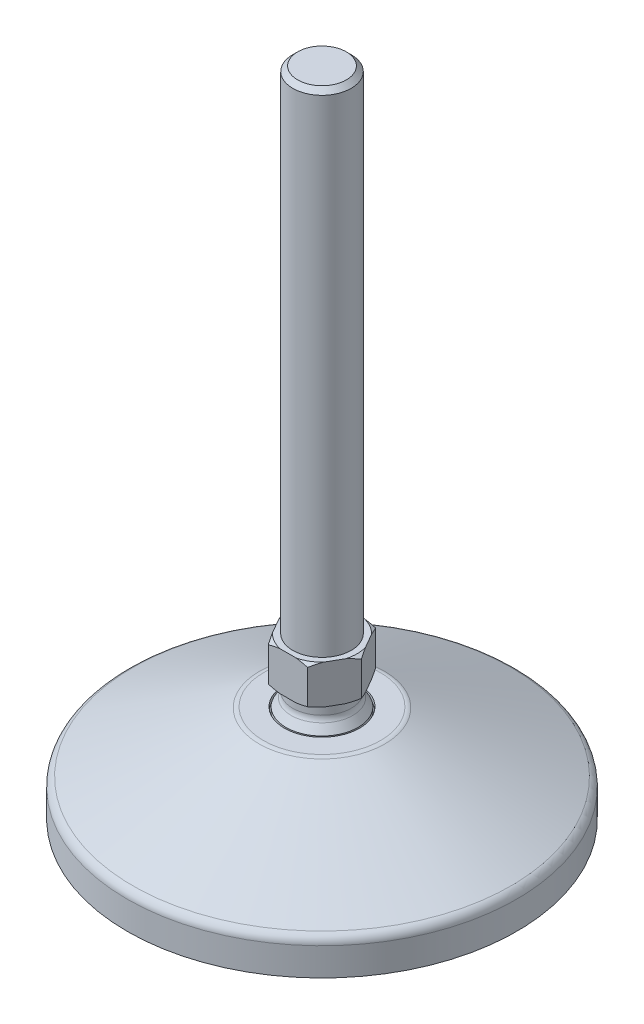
from build123d import *

# Parameters (mm, degrees)
SKETCH1_R           = 35
BOSS_EXTRUDE1_DEPTH = 2
SKETCH2_R           = 40
BOSS_EXTRUDE2_DEPTH = 7
SKETCH3_R           = 12.5
SKETCH4_R           = 7.4
SKETCH5_R           = 6
SKETCH11_R          = 7.7
SKETCH11_R_2        = 7.4
CUT_EXTRUDE1_DEPTH  = 1
SKETCH6_R           = 6
BOSS_EXTRUDE3_DEPTH = 2.9
SKETCH7_R           = 6
BOSS_EXTRUDE4_DEPTH = 109
SKETCH8_R           = 6
BOSS_EXTRUDE5_DEPTH = 8
CHAMFER1_SIZE       = 1
BOSS_EXTRUDE6_DEPTH = 1
FILLET1_R           = 2
FILLET2_R           = 2
FILLET3_R           = 1


with BuildPart() as part:
    # Sketch1 → Boss-Extrude1 (new body)
    with BuildSketch(Plane(origin=(0, 0, 0), x_dir=(1, 0, 0), z_dir=(0, 1, 0))):
        with Locations(Location((0, 0, 0), (0, 0, 270))):
            Circle(SKETCH1_R)
    extrude(amount=BOSS_EXTRUDE1_DEPTH)

    # Sketch2 → Boss-Extrude2 (add)
    with BuildSketch(Plane(origin=(0, 2, 0), x_dir=(1, 0, 0), z_dir=(0, 1, 0))):
        with Locations(Location((0, 0, 0), (0, 0, 270))):
            Circle(SKETCH2_R)
    extrude(amount=BOSS_EXTRUDE2_DEPTH)

    # Sketch3 → section 1 of loft1
    with BuildSketch(Plane(origin=(0, 22, 0), x_dir=(1, 0, 0), z_dir=(0, 1, 0)), mode=Mode.PRIVATE) as loft1_s1:
        Circle(SKETCH3_R)
    # loft up to a face of the part (loft1)
    loft([Face(Wire([part.edges().sort_by_distance((29.158745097, 9, -27.381884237))[0]])), loft1_s1.sketch])

    # Sketch4 → Loft2 section 0
    with BuildSketch(Plane(origin=(0, 22, 0), x_dir=(1, 0, 0), z_dir=(0, 1, 0))):
        Circle(SKETCH4_R)
    # Sketch5 → Loft2 section 1
    with BuildSketch(Plane(origin=(0, 24.1, 0), x_dir=(1, 0, 0), z_dir=(0, 1, 0))):
        Circle(SKETCH5_R)
    loft()

    # Sketch11 → Cut-Extrude1 (cut)
    with BuildSketch(Plane(origin=(0, 22, 0), x_dir=(1, 0, 0), z_dir=(0, 1, 0))):
        with Locations(Location((0, 0, 0), (0, 0, 270))):
            Circle(SKETCH11_R)
        with Locations(Location((0, 0, 0), (0, 0, 270))):
            Circle(SKETCH11_R_2, mode=Mode.SUBTRACT)
    extrude(amount=-CUT_EXTRUDE1_DEPTH, mode=Mode.SUBTRACT)

    # Sketch6 → Boss-Extrude3 (add)
    with BuildSketch(Plane(origin=(0, 24.1, 0), x_dir=(1, 0, 0), z_dir=(0, 1, 0))):
        with Locations(Location((0, 0, 0), (0, 0, 270))):
            Circle(SKETCH6_R)
    extrude(amount=BOSS_EXTRUDE3_DEPTH)

    # Sketch7 → Boss-Extrude4 (add)
    with BuildSketch(Plane(origin=(0, 27, 0), x_dir=(1, 0, 0), z_dir=(0, 1, 0))):
        with Locations(Location((0, 0, 0), (0, 0, 270))):
            Circle(SKETCH7_R)
    extrude(amount=BOSS_EXTRUDE4_DEPTH)

    # Sketch8 → Boss-Extrude5 (add)
    with BuildSketch(Plane(origin=(0, 27, 0), x_dir=(1, 0, 0), z_dir=(0, 1, 0))):
        Polygon((8.082903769, 0), (4.041451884, 7), (-4.041451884, 7), (-8.082903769, 0), (-4.041451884, -7), (4.041451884, -7), align=None)
        with Locations(Location((0, 0, 0), (0, 0, 270))):
            Circle(SKETCH8_R, mode=Mode.SUBTRACT)
    extrude(amount=BOSS_EXTRUDE5_DEPTH)

    # Sketch9 → Cut-Revolve1 (revolve, cut)
    with BuildSketch(Plane.XY, mode=Mode.PRIVATE) as cut_revolve1_sk:
        Polygon((-7.2, 35), (-8.082903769, 34.5), (-8.082903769, 35), align=None)
        Polygon((-8.082903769, 27.5), (-7.2, 27), (-8.082903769, 27), align=None)
    revolve(cut_revolve1_sk.sketch.rotate(Axis((0, 27, 0), (0, -1, 0)), 90), axis=Axis((0, 27, 0), (0, -1, 0)), mode=Mode.SUBTRACT)

    # Chamfer1
    chamfer1_edges = [part.edges().sort_by_distance(p)[0] for p in [
        (0, 136, -6),
    ]]
    chamfer(chamfer1_edges, length=CHAMFER1_SIZE)

    # Sketch10 → Boss-Extrude6 (add)
    with BuildSketch(Plane.XZ):
        with BuildLine():
            Line((3, 6), (30.923292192, 6))
            ThreePointArc((30.923292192, 6), (21.176389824, 23.319745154), (3, 31.356817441))
            Line((3, 31.356817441), (3, 6))
        make_face()
        with BuildLine():
            Line((-3, -31.356817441), (-3, -6))
            Line((-3, -6), (-30.923292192, -6))
            ThreePointArc((-30.923292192, -6), (-21.176389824, -23.319745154), (-3, -31.356817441))
        make_face()
        with BuildLine():
            Line((3, -31.356817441), (3, -6))
            Line((3, -6), (30.923292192, -6))
            ThreePointArc((30.923292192, -6), (21.176389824, -23.319745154), (3, -31.356817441))
        make_face()
        with BuildLine():
            Line((-30.923292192, 6), (-3, 6))
            Line((-3, 6), (-3, 31.356817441))
            ThreePointArc((-3, 31.356817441), (-21.176389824, 23.319745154), (-30.923292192, 6))
        make_face()
    extrude(amount=BOSS_EXTRUDE6_DEPTH)

    # Fillet1
    fillet1_edges = [part.edges().sort_by_distance(p)[0] for p in [
        (0, 22, -12.5),
        (0, 9, -40),
    ]]
    fillet(fillet1_edges, radius=FILLET1_R)

    # Fillet2
    fillet2_edges = [part.edges().sort_by_distance(p)[0] for p in [
        (-4.242640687, 24.1, -4.242640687),
    ]]
    fillet(fillet2_edges, radius=FILLET2_R)

    # Fillet3
    fillet3_edges = [part.edges().sort_by_distance(p)[0] for p in [
        (3, -0.5, 31.356817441),
        (3, -0.5, 6),
        (30.923292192, -0.5, 6),
        (-30.923292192, -0.5, -6),
        (-3, -0.5, -31.356817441),
        (-3, -0.5, -6),
        (-3, -0.5, 31.356817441),
        (-30.923292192, -0.5, 6),
        (-3, -0.5, 6),
        (3, -0.5, -31.356817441),
        (30.923292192, -0.5, -6),
        (3, -0.5, -6),
    ]]
    fillet(fillet3_edges, radius=FILLET3_R)


solid = part.part
